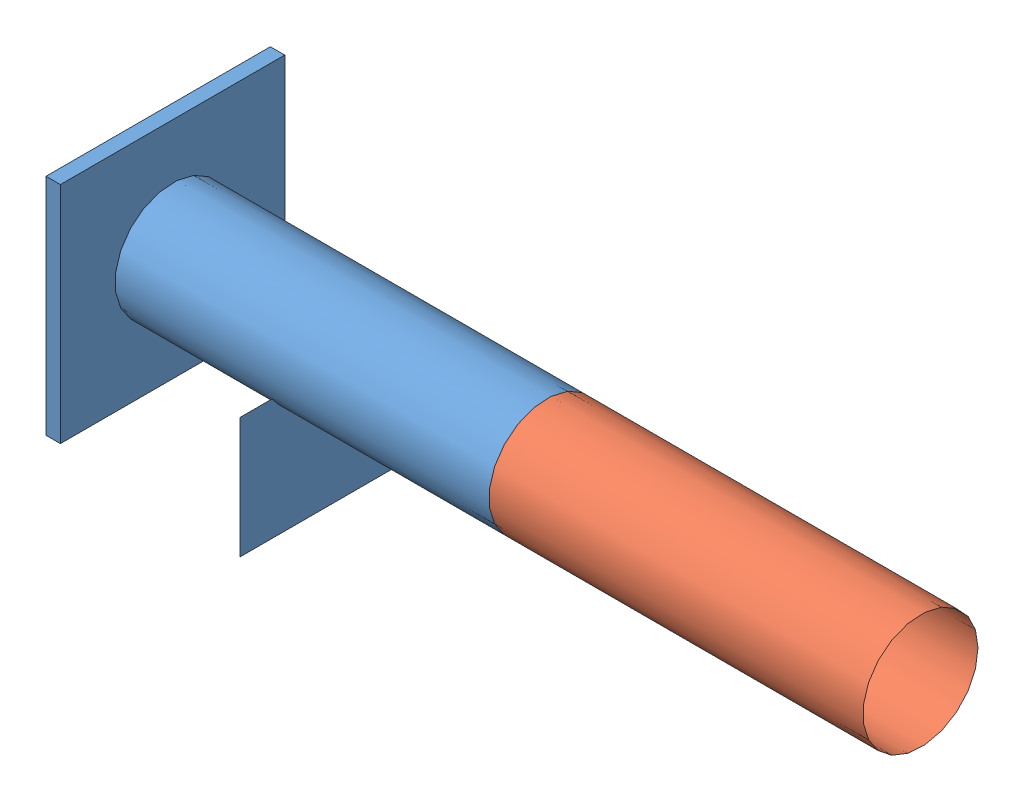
SolidWorks assembly Pipes.SLDASM, configuration Default (file format 14000). Lengths in mm.
Overall size (2650 923.29 780).
2 component instances, 2 part files, 1 mates.
Components (placement in the parent):
- torque tube-1: torque tube.SLDPRT [Default] at (-64.7046 22.7753 2.9732) size (1350 923.29 780)
- Part1-1: Part1.sldprt [Default] at (1235.2954 -33.9911 -85.723) x (0 0 -1) z (1 0 0) size (400 400 1300)
Mates (geometry in assembly coordinates):
- Coincident5: coincident aligned: circle of torque tube-1; circle of Part1-1
